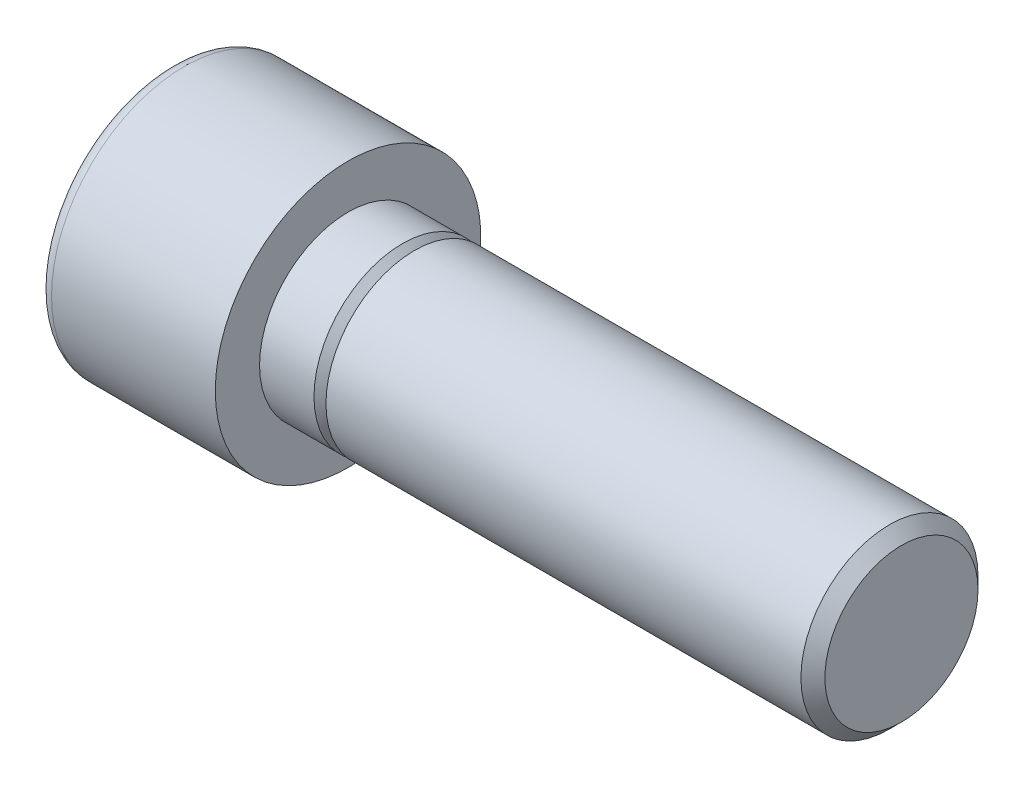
ISO-10303-21;
HEADER;
FILE_DESCRIPTION(('STEP AP214'),'2;1');
FILE_NAME('part.step','',(''),(''),'','','');
FILE_SCHEMA(('AUTOMOTIVE_DESIGN { 1 0 10303 214 1 1 1 1 }'));
ENDSEC;
DATA;
#1=APPLICATION_CONTEXT('core data for automotive mechanical design processes');
#2=APPLICATION_PROTOCOL_DEFINITION('international standard','automotive_design',2000,#1);
#3=PRODUCT_CONTEXT('',#1,'mechanical');
#4=PRODUCT('Part','Part','',(#3));
#5=PRODUCT_RELATED_PRODUCT_CATEGORY('part','',(#4));
#6=PRODUCT_DEFINITION_FORMATION('','',#4);
#7=PRODUCT_DEFINITION_CONTEXT('part definition',#1,'design');
#8=PRODUCT_DEFINITION('design','',#6,#7);
#9=PRODUCT_DEFINITION_SHAPE('','',#8);
#10=(LENGTH_UNIT() NAMED_UNIT(*) SI_UNIT(.MILLI.,.METRE.));
#11=(NAMED_UNIT(*) PLANE_ANGLE_UNIT() SI_UNIT($,.RADIAN.));
#12=(NAMED_UNIT(*) SI_UNIT($,.STERADIAN.) SOLID_ANGLE_UNIT());
#13=UNCERTAINTY_MEASURE_WITH_UNIT(LENGTH_MEASURE(1.E-05),#10,'distance_accuracy_value','');
#14=(GEOMETRIC_REPRESENTATION_CONTEXT(3) GLOBAL_UNCERTAINTY_ASSIGNED_CONTEXT((#13)) GLOBAL_UNIT_ASSIGNED_CONTEXT((#10,
#11,#12)) REPRESENTATION_CONTEXT('',''));
#15=CARTESIAN_POINT('',(0.,0.,0.));
#16=DIRECTION('',(0.,0.,1.));
#17=DIRECTION('',(1.,0.,0.));
#18=AXIS2_PLACEMENT_3D('',#15,#16,#17);
#19=CARTESIAN_POINT('',(80.,0.,0.));
#20=DIRECTION('',(-1.,0.,0.));
#21=DIRECTION('',(0.,0.,1.));
#22=AXIS2_PLACEMENT_3D('',#19,#20,#21);
#23=CYLINDRICAL_SURFACE('',#22,8.);
#24=CARTESIAN_POINT('',(78.9175,0.,0.));
#25=DIRECTION('',(1.,0.,0.));
#26=DIRECTION('',(0.,0.,-1.));
#27=AXIS2_PLACEMENT_3D('',#24,#25,#26);
#28=CIRCLE('',#27,8.);
#29=CARTESIAN_POINT('',(78.9175,0.,-8.));
#30=VERTEX_POINT('',#29);
#31=EDGE_CURVE('E153',#30,#30,#28,.F.);
#32=ORIENTED_EDGE('',*,*,#31,.T.);
#33=EDGE_LOOP('',(#32));
#34=FACE_BOUND('',#33,.T.);
#35=CARTESIAN_POINT('',(36.,0.,0.));
#36=DIRECTION('',(-1.,0.,0.));
#37=DIRECTION('',(0.,0.,1.));
#38=AXIS2_PLACEMENT_3D('',#35,#36,#37);
#39=CIRCLE('',#38,8.);
#40=CARTESIAN_POINT('',(36.,0.,8.));
#41=VERTEX_POINT('',#40);
#42=EDGE_CURVE('E133',#41,#41,#39,.T.);
#43=ORIENTED_EDGE('',*,*,#42,.F.);
#44=EDGE_LOOP('',(#43));
#45=FACE_BOUND('',#44,.T.);
#46=ADVANCED_FACE('F31',(#34,#45),#23,.T.);
#47=CARTESIAN_POINT('',(80.,8.,0.));
#48=DIRECTION('',(1.,0.,0.));
#49=DIRECTION('',(0.,0.,-1.));
#50=AXIS2_PLACEMENT_3D('',#47,#48,#49);
#51=PLANE('',#50);
#52=CARTESIAN_POINT('',(80.,0.,0.));
#53=DIRECTION('',(1.,0.,0.));
#54=DIRECTION('',(0.,0.,-1.));
#55=AXIS2_PLACEMENT_3D('',#52,#53,#54);
#56=CIRCLE('',#55,6.91749999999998);
#57=CARTESIAN_POINT('',(80.,0.,-6.91749999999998));
#58=VERTEX_POINT('',#57);
#59=EDGE_CURVE('E156',#58,#58,#56,.T.);
#60=ORIENTED_EDGE('',*,*,#59,.T.);
#61=EDGE_LOOP('',(#60));
#62=FACE_BOUND('',#61,.T.);
#63=ADVANCED_FACE('F173',(#62),#51,.T.);
#64=CARTESIAN_POINT('',(14.,0.,0.));
#65=DIRECTION('',(-1.,0.,0.));
#66=DIRECTION('',(0.,0.,1.));
#67=AXIS2_PLACEMENT_3D('',#64,#65,#66);
#68=PLANE('',#67);
#69=CARTESIAN_POINT('',(14.,0.,0.));
#70=DIRECTION('',(-1.,0.,0.));
#71=DIRECTION('',(0.,0.,1.));
#72=AXIS2_PLACEMENT_3D('',#69,#70,#71);
#73=CIRCLE('',#72,10.8);
#74=CARTESIAN_POINT('',(14.,0.,10.8));
#75=VERTEX_POINT('',#74);
#76=EDGE_CURVE('E39',#75,#75,#73,.T.);
#77=ORIENTED_EDGE('',*,*,#76,.T.);
#78=EDGE_LOOP('',(#77));
#79=FACE_BOUND('',#78,.T.);
#80=DIRECTION('',(0.,-1.,0.));
#81=VECTOR('',#80,1.);
#82=CARTESIAN_POINT('',(14.,4.04145188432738,-7.));
#83=LINE('',#82,#81);
#84=CARTESIAN_POINT('',(14.,4.04145188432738,-7.));
#85=VERTEX_POINT('',#84);
#86=CARTESIAN_POINT('',(14.,-4.04145188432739,-7.));
#87=VERTEX_POINT('',#86);
#88=EDGE_CURVE('E46',#85,#87,#83,.T.);
#89=ORIENTED_EDGE('',*,*,#88,.F.);
#90=DIRECTION('',(0.,-0.5,-0.866025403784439));
#91=VECTOR('',#90,1.);
#92=CARTESIAN_POINT('',(14.,8.08290376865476,0.));
#93=LINE('',#92,#91);
#94=CARTESIAN_POINT('',(14.,8.08290376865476,0.));
#95=VERTEX_POINT('',#94);
#96=EDGE_CURVE('E129',#95,#85,#93,.T.);
#97=ORIENTED_EDGE('',*,*,#96,.F.);
#98=DIRECTION('',(0.,0.499999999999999,-0.866025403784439));
#99=VECTOR('',#98,1.);
#100=CARTESIAN_POINT('',(14.,4.04145188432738,7.));
#101=LINE('',#100,#99);
#102=CARTESIAN_POINT('',(14.,4.04145188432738,7.));
#103=VERTEX_POINT('',#102);
#104=EDGE_CURVE('E127',#103,#95,#101,.T.);
#105=ORIENTED_EDGE('',*,*,#104,.F.);
#106=DIRECTION('',(0.,1.,0.));
#107=VECTOR('',#106,1.);
#108=CARTESIAN_POINT('',(14.,-4.04145188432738,7.));
#109=LINE('',#108,#107);
#110=CARTESIAN_POINT('',(14.,-4.04145188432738,7.));
#111=VERTEX_POINT('',#110);
#112=EDGE_CURVE('E94',#111,#103,#109,.T.);
#113=ORIENTED_EDGE('',*,*,#112,.F.);
#114=DIRECTION('',(0.,0.5,0.866025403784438));
#115=VECTOR('',#114,1.);
#116=CARTESIAN_POINT('',(14.,-8.08290376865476,0.));
#117=LINE('',#116,#115);
#118=CARTESIAN_POINT('',(14.,-8.08290376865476,0.));
#119=VERTEX_POINT('',#118);
#120=EDGE_CURVE('E123',#119,#111,#117,.T.);
#121=ORIENTED_EDGE('',*,*,#120,.F.);
#122=DIRECTION('',(0.,-0.499999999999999,0.866025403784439));
#123=VECTOR('',#122,1.);
#124=CARTESIAN_POINT('',(14.,-4.04145188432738,-7.));
#125=LINE('',#124,#123);
#126=EDGE_CURVE('E120',#87,#119,#125,.T.);
#127=ORIENTED_EDGE('',*,*,#126,.F.);
#128=EDGE_LOOP('',(#89,#97,#105,#113,#121,#127));
#129=FACE_BOUND('',#128,.T.);
#130=ADVANCED_FACE('F161',(#79,#129),#68,.T.);
#131=CARTESIAN_POINT('',(80.,0.,0.));
#132=DIRECTION('',(-1.,0.,0.));
#133=DIRECTION('',(0.,0.,1.));
#134=AXIS2_PLACEMENT_3D('',#131,#132,#133);
#135=CYLINDRICAL_SURFACE('',#134,12.);
#136=CARTESIAN_POINT('',(15.2,0.,0.));
#137=DIRECTION('',(-1.,0.,0.));
#138=DIRECTION('',(0.,0.,1.));
#139=AXIS2_PLACEMENT_3D('',#136,#137,#138);
#140=CIRCLE('',#139,12.);
#141=CARTESIAN_POINT('',(15.2,0.,12.));
#142=VERTEX_POINT('',#141);
#143=EDGE_CURVE('E11',#142,#142,#140,.F.);
#144=ORIENTED_EDGE('',*,*,#143,.T.);
#145=EDGE_LOOP('',(#144));
#146=FACE_BOUND('',#145,.T.);
#147=CARTESIAN_POINT('',(30.,0.,0.));
#148=DIRECTION('',(-1.,0.,0.));
#149=DIRECTION('',(0.,0.,1.));
#150=AXIS2_PLACEMENT_3D('',#147,#148,#149);
#151=CIRCLE('',#150,12.);
#152=CARTESIAN_POINT('',(30.,0.,12.));
#153=VERTEX_POINT('',#152);
#154=EDGE_CURVE('E150',#153,#153,#151,.T.);
#155=ORIENTED_EDGE('',*,*,#154,.T.);
#156=EDGE_LOOP('',(#155));
#157=FACE_BOUND('',#156,.T.);
#158=ADVANCED_FACE('F185',(#146,#157),#135,.T.);
#159=CARTESIAN_POINT('',(30.,12.,0.));
#160=DIRECTION('',(1.,0.,0.));
#161=DIRECTION('',(0.,0.,-1.));
#162=AXIS2_PLACEMENT_3D('',#159,#160,#161);
#163=PLANE('',#162);
#164=CARTESIAN_POINT('',(30.,0.,0.));
#165=DIRECTION('',(-1.,0.,0.));
#166=DIRECTION('',(0.,0.,1.));
#167=AXIS2_PLACEMENT_3D('',#164,#165,#166);
#168=CIRCLE('',#167,8.00000000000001);
#169=CARTESIAN_POINT('',(30.,0.,8.00000000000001));
#170=VERTEX_POINT('',#169);
#171=EDGE_CURVE('E147',#170,#170,#168,.T.);
#172=ORIENTED_EDGE('',*,*,#171,.T.);
#173=EDGE_LOOP('',(#172));
#174=FACE_BOUND('',#173,.T.);
#175=ORIENTED_EDGE('',*,*,#154,.F.);
#176=EDGE_LOOP('',(#175));
#177=FACE_BOUND('',#176,.T.);
#178=ADVANCED_FACE('F188',(#174,#177),#163,.T.);
#179=CARTESIAN_POINT('',(80.,0.,0.));
#180=DIRECTION('',(-1.,0.,0.));
#181=DIRECTION('',(0.,0.,1.));
#182=AXIS2_PLACEMENT_3D('',#179,#180,#181);
#183=CYLINDRICAL_SURFACE('',#182,8.00000000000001);
#184=CARTESIAN_POINT('',(34.9175,0.,0.));
#185=DIRECTION('',(-1.,0.,0.));
#186=DIRECTION('',(0.,0.,1.));
#187=AXIS2_PLACEMENT_3D('',#184,#185,#186);
#188=CIRCLE('',#187,8.00000000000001);
#189=CARTESIAN_POINT('',(34.9175,0.,8.00000000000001));
#190=VERTEX_POINT('',#189);
#191=EDGE_CURVE('E144',#190,#190,#188,.T.);
#192=ORIENTED_EDGE('',*,*,#191,.T.);
#193=EDGE_LOOP('',(#192));
#194=FACE_BOUND('',#193,.T.);
#195=ORIENTED_EDGE('',*,*,#171,.F.);
#196=EDGE_LOOP('',(#195));
#197=FACE_BOUND('',#196,.T.);
#198=ADVANCED_FACE('F192',(#194,#197),#183,.T.);
#199=CARTESIAN_POINT('',(34.9175,0.,0.));
#200=DIRECTION('',(-1.,0.,0.));
#201=DIRECTION('',(0.,0.,1.));
#202=AXIS2_PLACEMENT_3D('',#199,#200,#201);
#203=CONICAL_SURFACE('',#202,8.00000000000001,0.785398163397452);
#204=CARTESIAN_POINT('',(36.,0.,0.));
#205=DIRECTION('',(-1.,0.,0.));
#206=DIRECTION('',(0.,0.,1.));
#207=AXIS2_PLACEMENT_3D('',#204,#205,#206);
#208=CIRCLE('',#207,6.9175);
#209=CARTESIAN_POINT('',(36.,0.,6.9175));
#210=VERTEX_POINT('',#209);
#211=EDGE_CURVE('E141',#210,#210,#208,.T.);
#212=ORIENTED_EDGE('',*,*,#211,.T.);
#213=EDGE_LOOP('',(#212));
#214=FACE_BOUND('',#213,.T.);
#215=ORIENTED_EDGE('',*,*,#191,.F.);
#216=EDGE_LOOP('',(#215));
#217=FACE_BOUND('',#216,.T.);
#218=ADVANCED_FACE('F196',(#214,#217),#203,.T.);
#219=CARTESIAN_POINT('',(36.,6.9175,0.));
#220=DIRECTION('',(-1.,0.,0.));
#221=DIRECTION('',(0.,0.,1.));
#222=AXIS2_PLACEMENT_3D('',#219,#220,#221);
#223=PLANE('',#222);
#224=ORIENTED_EDGE('',*,*,#42,.T.);
#225=EDGE_LOOP('',(#224));
#226=FACE_BOUND('',#225,.T.);
#227=ORIENTED_EDGE('',*,*,#211,.F.);
#228=EDGE_LOOP('',(#227));
#229=FACE_BOUND('',#228,.T.);
#230=ADVANCED_FACE('F200',(#226,#229),#223,.T.);
#231=CARTESIAN_POINT('',(22.,4.04145188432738,-7.));
#232=DIRECTION('',(0.,0.,-1.));
#233=DIRECTION('',(-1.,0.,0.));
#234=AXIS2_PLACEMENT_3D('',#231,#232,#233);
#235=PLANE('',#234);
#236=ORIENTED_EDGE('',*,*,#88,.T.);
#237=DIRECTION('',(-1.,0.,0.));
#238=VECTOR('',#237,1.);
#239=CARTESIAN_POINT('',(22.,-4.04145188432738,-7.));
#240=LINE('',#239,#238);
#241=CARTESIAN_POINT('',(22.,-4.04145188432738,-7.));
#242=VERTEX_POINT('',#241);
#243=EDGE_CURVE('E76',#242,#87,#240,.T.);
#244=ORIENTED_EDGE('',*,*,#243,.F.);
#245=DIRECTION('',(0.,-1.,0.));
#246=VECTOR('',#245,1.);
#247=CARTESIAN_POINT('',(22.,4.04145188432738,-7.));
#248=LINE('',#247,#246);
#249=CARTESIAN_POINT('',(22.,4.04145188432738,-7.));
#250=VERTEX_POINT('',#249);
#251=EDGE_CURVE('E131',#250,#242,#248,.T.);
#252=ORIENTED_EDGE('',*,*,#251,.F.);
#253=DIRECTION('',(-1.,0.,0.));
#254=VECTOR('',#253,1.);
#255=CARTESIAN_POINT('',(22.,4.04145188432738,-7.));
#256=LINE('',#255,#254);
#257=EDGE_CURVE('E54',#250,#85,#256,.T.);
#258=ORIENTED_EDGE('',*,*,#257,.T.);
#259=EDGE_LOOP('',(#236,#244,#252,#258));
#260=FACE_BOUND('',#259,.T.);
#261=ADVANCED_FACE('F204',(#260),#235,.F.);
#262=CARTESIAN_POINT('',(22.,8.08290376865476,0.));
#263=DIRECTION('',(0.,0.866025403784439,-0.5));
#264=DIRECTION('',(0.,0.5,0.866025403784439));
#265=AXIS2_PLACEMENT_3D('',#262,#263,#264);
#266=PLANE('',#265);
#267=ORIENTED_EDGE('',*,*,#96,.T.);
#268=ORIENTED_EDGE('',*,*,#257,.F.);
#269=DIRECTION('',(0.,-0.5,-0.866025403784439));
#270=VECTOR('',#269,1.);
#271=CARTESIAN_POINT('',(22.,8.08290376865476,0.));
#272=LINE('',#271,#270);
#273=CARTESIAN_POINT('',(22.,8.08290376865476,0.));
#274=VERTEX_POINT('',#273);
#275=EDGE_CURVE('E106',#274,#250,#272,.T.);
#276=ORIENTED_EDGE('',*,*,#275,.F.);
#277=DIRECTION('',(-1.,0.,0.));
#278=VECTOR('',#277,1.);
#279=CARTESIAN_POINT('',(22.,8.08290376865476,0.));
#280=LINE('',#279,#278);
#281=EDGE_CURVE('E98',#274,#95,#280,.T.);
#282=ORIENTED_EDGE('',*,*,#281,.T.);
#283=EDGE_LOOP('',(#267,#268,#276,#282));
#284=FACE_BOUND('',#283,.T.);
#285=ADVANCED_FACE('F208',(#284),#266,.F.);
#286=CARTESIAN_POINT('',(22.,4.04145188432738,7.));
#287=DIRECTION('',(0.,0.866025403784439,0.5));
#288=DIRECTION('',(0.,-0.499999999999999,0.866025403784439));
#289=AXIS2_PLACEMENT_3D('',#286,#287,#288);
#290=PLANE('',#289);
#291=ORIENTED_EDGE('',*,*,#104,.T.);
#292=ORIENTED_EDGE('',*,*,#281,.F.);
#293=DIRECTION('',(0.,0.499999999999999,-0.866025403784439));
#294=VECTOR('',#293,1.);
#295=CARTESIAN_POINT('',(22.,4.04145188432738,7.));
#296=LINE('',#295,#294);
#297=CARTESIAN_POINT('',(22.,4.04145188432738,7.));
#298=VERTEX_POINT('',#297);
#299=EDGE_CURVE('E102',#298,#274,#296,.T.);
#300=ORIENTED_EDGE('',*,*,#299,.F.);
#301=DIRECTION('',(-1.,0.,0.));
#302=VECTOR('',#301,1.);
#303=CARTESIAN_POINT('',(22.,4.04145188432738,7.));
#304=LINE('',#303,#302);
#305=EDGE_CURVE('E87',#298,#103,#304,.T.);
#306=ORIENTED_EDGE('',*,*,#305,.T.);
#307=EDGE_LOOP('',(#291,#292,#300,#306));
#308=FACE_BOUND('',#307,.T.);
#309=ADVANCED_FACE('F103',(#308),#290,.F.);
#310=CARTESIAN_POINT('',(22.,-4.04145188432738,7.));
#311=DIRECTION('',(0.,0.,1.));
#312=DIRECTION('',(1.,0.,0.));
#313=AXIS2_PLACEMENT_3D('',#310,#311,#312);
#314=PLANE('',#313);
#315=ORIENTED_EDGE('',*,*,#112,.T.);
#316=ORIENTED_EDGE('',*,*,#305,.F.);
#317=DIRECTION('',(0.,1.,0.));
#318=VECTOR('',#317,1.);
#319=CARTESIAN_POINT('',(22.,-4.04145188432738,7.));
#320=LINE('',#319,#318);
#321=CARTESIAN_POINT('',(22.,-4.04145188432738,7.));
#322=VERTEX_POINT('',#321);
#323=EDGE_CURVE('E91',#322,#298,#320,.T.);
#324=ORIENTED_EDGE('',*,*,#323,.F.);
#325=DIRECTION('',(-1.,0.,0.));
#326=VECTOR('',#325,1.);
#327=CARTESIAN_POINT('',(22.,-4.04145188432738,7.));
#328=LINE('',#327,#326);
#329=EDGE_CURVE('E99',#322,#111,#328,.T.);
#330=ORIENTED_EDGE('',*,*,#329,.T.);
#331=EDGE_LOOP('',(#315,#316,#324,#330));
#332=FACE_BOUND('',#331,.T.);
#333=ADVANCED_FACE('F89',(#332),#314,.F.);
#334=CARTESIAN_POINT('',(22.,-8.08290376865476,0.));
#335=DIRECTION('',(0.,-0.866025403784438,0.5));
#336=DIRECTION('',(0.,-0.5,-0.866025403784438));
#337=AXIS2_PLACEMENT_3D('',#334,#335,#336);
#338=PLANE('',#337);
#339=ORIENTED_EDGE('',*,*,#120,.T.);
#340=ORIENTED_EDGE('',*,*,#329,.F.);
#341=DIRECTION('',(0.,0.5,0.866025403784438));
#342=VECTOR('',#341,1.);
#343=CARTESIAN_POINT('',(22.,-8.08290376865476,0.));
#344=LINE('',#343,#342);
#345=CARTESIAN_POINT('',(22.,-8.08290376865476,0.));
#346=VERTEX_POINT('',#345);
#347=EDGE_CURVE('E112',#346,#322,#344,.T.);
#348=ORIENTED_EDGE('',*,*,#347,.F.);
#349=DIRECTION('',(-1.,0.,0.));
#350=VECTOR('',#349,1.);
#351=CARTESIAN_POINT('',(22.,-8.08290376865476,0.));
#352=LINE('',#351,#350);
#353=EDGE_CURVE('E136',#346,#119,#352,.T.);
#354=ORIENTED_EDGE('',*,*,#353,.T.);
#355=EDGE_LOOP('',(#339,#340,#348,#354));
#356=FACE_BOUND('',#355,.T.);
#357=ADVANCED_FACE('F212',(#356),#338,.F.);
#358=CARTESIAN_POINT('',(22.,-4.04145188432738,-7.));
#359=DIRECTION('',(0.,-0.866025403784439,-0.5));
#360=DIRECTION('',(0.,0.499999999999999,-0.866025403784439));
#361=AXIS2_PLACEMENT_3D('',#358,#359,#360);
#362=PLANE('',#361);
#363=ORIENTED_EDGE('',*,*,#126,.T.);
#364=ORIENTED_EDGE('',*,*,#353,.F.);
#365=DIRECTION('',(0.,-0.499999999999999,0.866025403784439));
#366=VECTOR('',#365,1.);
#367=CARTESIAN_POINT('',(22.,-4.04145188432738,-7.));
#368=LINE('',#367,#366);
#369=EDGE_CURVE('E114',#242,#346,#368,.T.);
#370=ORIENTED_EDGE('',*,*,#369,.F.);
#371=ORIENTED_EDGE('',*,*,#243,.T.);
#372=EDGE_LOOP('',(#363,#364,#370,#371));
#373=FACE_BOUND('',#372,.T.);
#374=ADVANCED_FACE('F209',(#373),#362,.F.);
#375=CARTESIAN_POINT('',(22.,-4.04145188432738,-7.));
#376=DIRECTION('',(-1.,0.,0.));
#377=DIRECTION('',(0.,0.,1.));
#378=AXIS2_PLACEMENT_3D('',#375,#376,#377);
#379=PLANE('',#378);
#380=ORIENTED_EDGE('',*,*,#251,.T.);
#381=ORIENTED_EDGE('',*,*,#369,.T.);
#382=ORIENTED_EDGE('',*,*,#347,.T.);
#383=ORIENTED_EDGE('',*,*,#323,.T.);
#384=ORIENTED_EDGE('',*,*,#299,.T.);
#385=ORIENTED_EDGE('',*,*,#275,.T.);
#386=EDGE_LOOP('',(#380,#381,#382,#383,#384,#385));
#387=FACE_BOUND('',#386,.T.);
#388=ADVANCED_FACE('F109',(#387),#379,.T.);
#389=CARTESIAN_POINT('',(78.9175,0.,0.));
#390=DIRECTION('',(-1.,0.,0.));
#391=DIRECTION('',(0.,0.,1.));
#392=AXIS2_PLACEMENT_3D('',#389,#390,#391);
#393=CONICAL_SURFACE('',#392,8.,0.785398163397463);
#394=ORIENTED_EDGE('',*,*,#59,.F.);
#395=EDGE_LOOP('',(#394));
#396=FACE_BOUND('',#395,.T.);
#397=ORIENTED_EDGE('',*,*,#31,.F.);
#398=EDGE_LOOP('',(#397));
#399=FACE_BOUND('',#398,.T.);
#400=ADVANCED_FACE('F165',(#396,#399),#393,.T.);
#401=CARTESIAN_POINT('',(15.2,0.,0.));
#402=DIRECTION('',(-1.,0.,0.));
#403=DIRECTION('',(0.,0.,1.));
#404=AXIS2_PLACEMENT_3D('',#401,#402,#403);
#405=TOROIDAL_SURFACE('',#404,10.8,1.2);
#406=ORIENTED_EDGE('',*,*,#143,.F.);
#407=EDGE_LOOP('',(#406));
#408=FACE_BOUND('',#407,.T.);
#409=ORIENTED_EDGE('',*,*,#76,.F.);
#410=EDGE_LOOP('',(#409));
#411=FACE_BOUND('',#410,.T.);
#412=ADVANCED_FACE('F33',(#408,#411),#405,.T.);
#413=CLOSED_SHELL('',(#46,#63,#130,#158,#178,#198,#218,#230,#261,#285,#309,#333,#357,#374,#388,
#400,#412));
#414=MANIFOLD_SOLID_BREP('B2',#413);
#415=ADVANCED_BREP_SHAPE_REPRESENTATION('',(#18,#414),#14);
#416=SHAPE_DEFINITION_REPRESENTATION(#9,#415);
ENDSEC;
END-ISO-10303-21;
